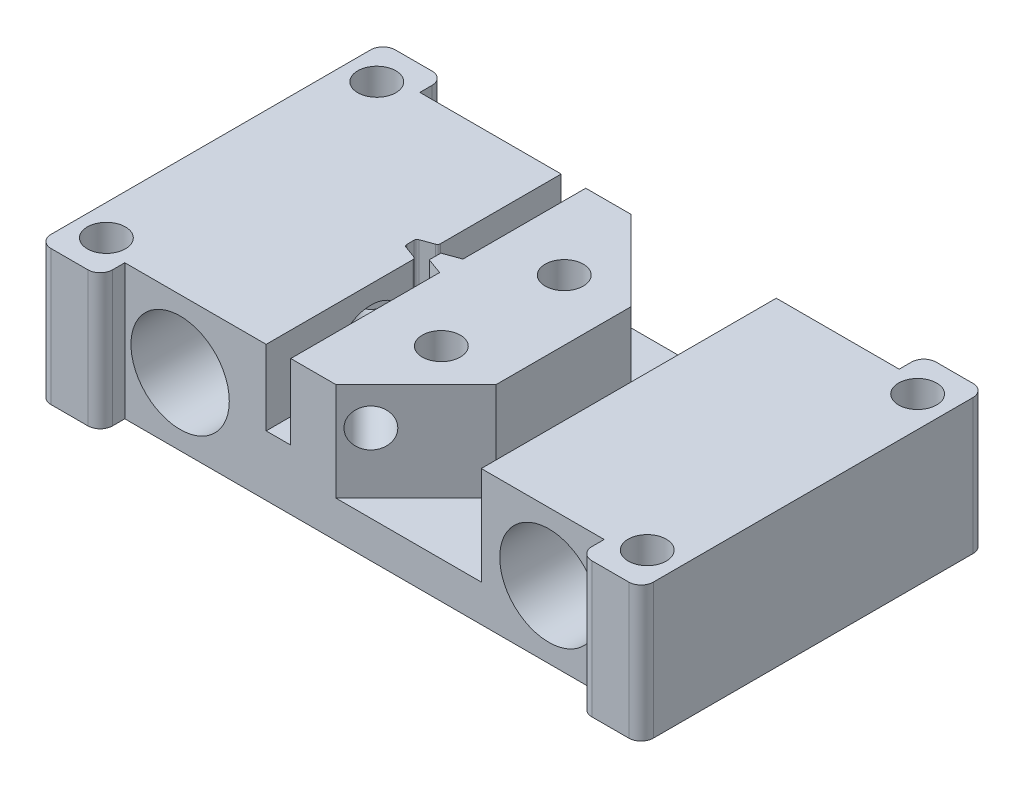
from build123d import *

# Parameters (mm, degrees)
SCHIZZO1_W                   = 49
SCHIZZO1_H                   = 11
SCHIZZO1_R                   = 4
ESTRUSIONE_ESTRUSIONE1_DEPTH = 24
TAGLIO_ESTRUSIONE2_DEPTH     = 6.1
TAGLIO_ESTRUSIONE3_DEPTH     = 8
SCHIZZO5_W                   = 5
SCHIZZO5_H                   = 2
ESTRUSIONE_ESTRUSIONE2_DEPTH = 11
SCHIZZO2_R                   = 1.55
TAGLIO_ESTRUSIONE1_DEPTH     = 38.379807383
RACCORDO1_R                  = 1
SCHIZZO6_R                   = 1.55
TAGLIO_ESTRUSIONE4_DEPTH     = 6
SCHIZZO7_R                   = 1.55
TAGLIO_ESTRUSIONE5_DEPTH     = 6
SCHIZZO12_R                  = 1.55
TAGLIO_ESTRUSIONE7_DEPTH     = 14


with BuildPart() as part:
    # Schizzo1 → Estrusione-Estrusione1 (new body)
    with BuildSketch(Plane.XY):
        Rectangle(SCHIZZO1_W, SCHIZZO1_H)
        with Locations((-15, 0)):
            Circle(SCHIZZO1_R, mode=Mode.SUBTRACT)
        with Locations((15, 0)):
            Circle(SCHIZZO1_R, mode=Mode.SUBTRACT)
    extrude(amount=ESTRUSIONE_ESTRUSIONE1_DEPTH)

    # Schizzo3 → Taglio-Estrusione2 (cut)
    with BuildSketch(Plane(origin=(0, 5.5, 0), x_dir=(1, 0, 0), z_dir=(0, 1, 0))):
        with BuildLine():
            Line((-8, 0), (-6, 0))
            Line((-6, 0), (-6, -9.989911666))
            Line((-6, -9.989911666), (-7.32, -10.470352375))
            Line((-7.32, -10.470352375), (-7.32, -11.407499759))
            Line((-7.32, -11.407499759), (-6, -11.887940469))
            Line((-6, -11.887940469), (-6, -24))
            Line((-6, -24), (-8, -24))
            Line((-8, -24), (-8, -12.062992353))
            ThreePointArc((-8, -12.062992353), (-8.045211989, -11.919598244), (-8.164494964, -11.828069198))
            Line((-8.164494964, -11.828069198), (-9.155505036, -11.46737103))
            ThreePointArc((-9.155505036, -11.46737103), (-9.274788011, -11.375841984), (-9.32, -11.232447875))
            Line((-9.32, -11.232447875), (-9.32, -10.645404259))
            ThreePointArc((-9.32, -10.645404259), (-9.274788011, -10.50201015), (-9.155505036, -10.410481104))
            Line((-9.155505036, -10.410481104), (-8.164494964, -10.049782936))
            ThreePointArc((-8.164494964, -10.049782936), (-8.045211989, -9.95825389), (-8, -9.814859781))
            Line((-8, -9.814859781), (-8, 0))
        make_face()
    extrude(amount=-TAGLIO_ESTRUSIONE2_DEPTH, mode=Mode.SUBTRACT)

    # Schizzo4 → Taglio-Estrusione3 (cut)
    with BuildSketch(Plane(origin=(0, 5.5, 0), x_dir=(1, 0, 0), z_dir=(0, 1, 0))):
        Polygon((4.5, 0), (9.5, 0), (9.5, -24), (4.5, -24), (-2.310193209, -24), (4.189806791, -17.5), (4.189806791, -6.5), (-2.310193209, 0), align=None)
    extrude(amount=-TAGLIO_ESTRUSIONE3_DEPTH, mode=Mode.SUBTRACT)

    # Schizzo5 → Estrusione-Estrusione2 (add)
    with BuildSketch(Plane(origin=(0, 5.5, 0), x_dir=(1, 0, 0), z_dir=(0, 1, 0))):
        with Locations((-22, 1)):
            Rectangle(SCHIZZO5_W, SCHIZZO5_H)
        with Locations((22, 1)):
            Rectangle(SCHIZZO5_W, SCHIZZO5_H)
        with Locations((22, -25)):
            Rectangle(SCHIZZO5_W, SCHIZZO5_H)
        with Locations((-22, -25)):
            Rectangle(SCHIZZO5_W, SCHIZZO5_H)
    extrude(amount=-ESTRUSIONE_ESTRUSIONE2_DEPTH)

    # Schizzo2 → Taglio-Estrusione1 (cut, through all)
    with BuildSketch(Plane.XZ.offset(5.5)):
        with Locations(Location((-22, 23, 0), (0, 0, 270))):
            Circle(SCHIZZO2_R)
        with Locations(Location((22, 23, 0), (0, 0, 270))):
            Circle(SCHIZZO2_R)
        with Locations(Location((22, 1, 0), (0, 0, 270))):
            Circle(SCHIZZO2_R)
        with Locations(Location((-22, 1, 0), (0, 0, 270))):
            Circle(SCHIZZO2_R)
    extrude(amount=-TAGLIO_ESTRUSIONE1_DEPTH, mode=Mode.SUBTRACT)

    # Raccordo1
    raccordo1_edges = [part.edges().sort_by_distance(p)[0] for p in [
        (24.5, 0, -2),
        (19.5, 0, -2),
        (24.5, 0, 26),
        (19.5, 0, 26),
        (-24.5, 0, 26),
        (-19.5, 0, 26),
        (-24.5, 0, -2),
        (-19.5, 0, -2),
    ]]
    fillet(raccordo1_edges, radius=RACCORDO1_R)

    # Schizzo6 → Taglio-Estrusione4 (cut)
    with BuildSketch(Plane(origin=(0, 5.5, 0), x_dir=(1, 0, 0), z_dir=(0, 1, 0))):
        with Locations(Location((-0.75, -7, 0), (0, 0, 270))):
            Circle(SCHIZZO6_R)
        with Locations(Location((-0.75, -17, 0), (0, 0, 270))):
            Circle(SCHIZZO6_R)
    extrude(amount=-TAGLIO_ESTRUSIONE4_DEPTH, mode=Mode.SUBTRACT)

    # Schizzo7 → Taglio-Estrusione5 (cut)
    with BuildSketch(Plane.XZ.offset(5.5)):
        with Locations(Location((-15, 17, 0), (0, 0, 270))):
            Circle(SCHIZZO7_R)
        with Locations(Location((15, 17, 0), (0, 0, 270))):
            Circle(SCHIZZO7_R)
        with Locations(Location((15, 7, 0), (0, 0, 270))):
            Circle(SCHIZZO7_R)
        with Locations(Location((-15, 7, 0), (0, 0, 270))):
            Circle(SCHIZZO7_R)
    extrude(amount=-TAGLIO_ESTRUSIONE5_DEPTH, mode=Mode.SUBTRACT)

    # Schizzo12 → Taglio-Estrusione7 (cut)
    with BuildSketch(Plane(origin=(10.844903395, 0, 10.844903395), x_dir=(0.7071067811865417, 0, -0.7071067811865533), z_dir=(0.7071067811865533, 0, 0.7071067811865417))):
        with Locations((-16.604116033, 2.45)):
            Circle(SCHIZZO12_R)
    extrude(amount=-TAGLIO_ESTRUSIONE7_DEPTH, mode=Mode.SUBTRACT)


solid = part.part
